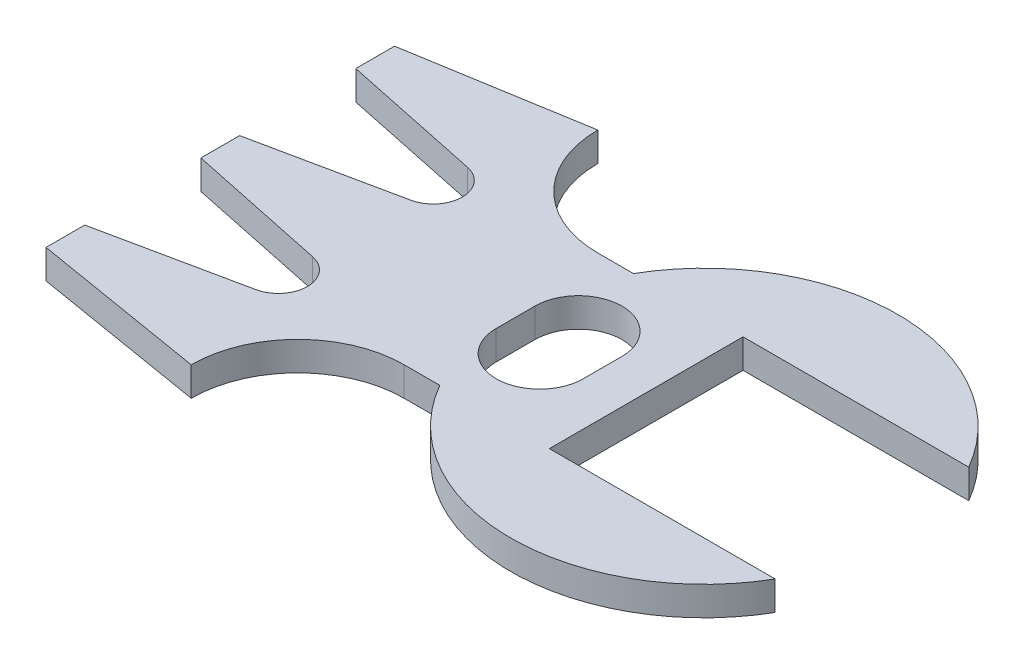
ISO-10303-21;
HEADER;
FILE_DESCRIPTION(('STEP AP214'),'2;1');
FILE_NAME('part.step','',(''),(''),'','','');
FILE_SCHEMA(('AUTOMOTIVE_DESIGN { 1 0 10303 214 1 1 1 1 }'));
ENDSEC;
DATA;
#1=APPLICATION_CONTEXT('core data for automotive mechanical design processes');
#2=APPLICATION_PROTOCOL_DEFINITION('international standard','automotive_design',2000,#1);
#3=PRODUCT_CONTEXT('',#1,'mechanical');
#4=PRODUCT('Part','Part','',(#3));
#5=PRODUCT_RELATED_PRODUCT_CATEGORY('part','',(#4));
#6=PRODUCT_DEFINITION_FORMATION('','',#4);
#7=PRODUCT_DEFINITION_CONTEXT('part definition',#1,'design');
#8=PRODUCT_DEFINITION('design','',#6,#7);
#9=PRODUCT_DEFINITION_SHAPE('','',#8);
#10=(LENGTH_UNIT() NAMED_UNIT(*) SI_UNIT(.MILLI.,.METRE.));
#11=(NAMED_UNIT(*) PLANE_ANGLE_UNIT() SI_UNIT($,.RADIAN.));
#12=(NAMED_UNIT(*) SI_UNIT($,.STERADIAN.) SOLID_ANGLE_UNIT());
#13=UNCERTAINTY_MEASURE_WITH_UNIT(LENGTH_MEASURE(1.E-05),#10,'distance_accuracy_value','');
#14=(GEOMETRIC_REPRESENTATION_CONTEXT(3) GLOBAL_UNCERTAINTY_ASSIGNED_CONTEXT((#13)) GLOBAL_UNIT_ASSIGNED_CONTEXT((#10,
#11,#12)) REPRESENTATION_CONTEXT('',''));
#15=CARTESIAN_POINT('',(0.,0.,0.));
#16=DIRECTION('',(0.,0.,1.));
#17=DIRECTION('',(1.,0.,0.));
#18=AXIS2_PLACEMENT_3D('',#15,#16,#17);
#19=CARTESIAN_POINT('',(50.,3.,-21.));
#20=DIRECTION('',(0.,1.,0.));
#21=DIRECTION('',(0.,0.,1.));
#22=AXIS2_PLACEMENT_3D('',#19,#20,#21);
#23=PLANE('',#22);
#24=CARTESIAN_POINT('',(50.,3.,-21.));
#25=DIRECTION('',(0.,1.,0.));
#26=DIRECTION('',(0.,0.,1.));
#27=AXIS2_PLACEMENT_3D('',#24,#25,#26);
#28=CIRCLE('',#27,20.);
#29=CARTESIAN_POINT('',(67.3205080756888,3.,-31.));
#30=VERTEX_POINT('',#29);
#31=CARTESIAN_POINT('',(32.6794919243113,3.,-31.));
#32=VERTEX_POINT('',#31);
#33=EDGE_CURVE('E228',#30,#32,#28,.T.);
#34=ORIENTED_EDGE('',*,*,#33,.T.);
#35=DIRECTION('',(-1.,0.,0.));
#36=VECTOR('',#35,1.);
#37=CARTESIAN_POINT('',(29.,3.,-31.));
#38=LINE('',#37,#36);
#39=CARTESIAN_POINT('',(29.,3.,-31.));
#40=VERTEX_POINT('',#39);
#41=EDGE_CURVE('E231',#32,#40,#38,.T.);
#42=ORIENTED_EDGE('',*,*,#41,.T.);
#43=CARTESIAN_POINT('',(29.,3.,-42.));
#44=DIRECTION('',(0.,-1.,0.));
#45=DIRECTION('',(0.,0.,1.));
#46=AXIS2_PLACEMENT_3D('',#43,#44,#45);
#47=CIRCLE('',#46,11.);
#48=CARTESIAN_POINT('',(18.,3.,-42.));
#49=VERTEX_POINT('',#48);
#50=EDGE_CURVE('E234',#40,#49,#47,.T.);
#51=ORIENTED_EDGE('',*,*,#50,.T.);
#52=DIRECTION('',(-0.986393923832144,0.,0.164398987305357));
#53=VECTOR('',#52,1.);
#54=CARTESIAN_POINT('',(18.,3.,-42.));
#55=LINE('',#54,#53);
#56=CARTESIAN_POINT('',(0.,3.,-39.));
#57=VERTEX_POINT('',#56);
#58=EDGE_CURVE('E236',#49,#57,#55,.T.);
#59=ORIENTED_EDGE('',*,*,#58,.T.);
#60=DIRECTION('',(0.,0.,1.));
#61=VECTOR('',#60,1.);
#62=CARTESIAN_POINT('',(0.,3.,-35.));
#63=LINE('',#62,#61);
#64=CARTESIAN_POINT('',(0.,3.,-35.));
#65=VERTEX_POINT('',#64);
#66=EDGE_CURVE('E238',#57,#65,#63,.T.);
#67=ORIENTED_EDGE('',*,*,#66,.T.);
#68=DIRECTION('',(0.978726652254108,0.,0.205168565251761));
#69=VECTOR('',#68,1.);
#70=CARTESIAN_POINT('',(0.,3.,-35.));
#71=LINE('',#70,#69);
#72=CARTESIAN_POINT('',(14.6155056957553,3.,-31.9361799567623));
#73=VERTEX_POINT('',#72);
#74=EDGE_CURVE('E240',#65,#73,#71,.T.);
#75=ORIENTED_EDGE('',*,*,#74,.T.);
#76=CARTESIAN_POINT('',(14.,3.,-29.));
#77=DIRECTION('',(0.,-1.,0.));
#78=DIRECTION('',(0.,0.,1.));
#79=AXIS2_PLACEMENT_3D('',#76,#77,#78);
#80=CIRCLE('',#79,2.99999999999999);
#81=CARTESIAN_POINT('',(14.6155056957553,3.,-26.0638200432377));
#82=VERTEX_POINT('',#81);
#83=EDGE_CURVE('E242',#73,#82,#80,.T.);
#84=ORIENTED_EDGE('',*,*,#83,.T.);
#85=DIRECTION('',(-0.978726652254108,0.,0.205168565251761));
#86=VECTOR('',#85,1.);
#87=CARTESIAN_POINT('',(0.,3.,-23.));
#88=LINE('',#87,#86);
#89=CARTESIAN_POINT('',(0.,3.,-23.));
#90=VERTEX_POINT('',#89);
#91=EDGE_CURVE('E244',#82,#90,#88,.T.);
#92=ORIENTED_EDGE('',*,*,#91,.T.);
#93=DIRECTION('',(0.,0.,1.));
#94=VECTOR('',#93,1.);
#95=CARTESIAN_POINT('',(0.,3.,-19.));
#96=LINE('',#95,#94);
#97=CARTESIAN_POINT('',(0.,3.,-19.));
#98=VERTEX_POINT('',#97);
#99=EDGE_CURVE('E246',#90,#98,#96,.T.);
#100=ORIENTED_EDGE('',*,*,#99,.T.);
#101=DIRECTION('',(0.978726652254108,0.,0.205168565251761));
#102=VECTOR('',#101,1.);
#103=CARTESIAN_POINT('',(0.,3.,-19.));
#104=LINE('',#103,#102);
#105=CARTESIAN_POINT('',(14.6155056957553,3.,-15.9361799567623));
#106=VERTEX_POINT('',#105);
#107=EDGE_CURVE('E248',#98,#106,#104,.T.);
#108=ORIENTED_EDGE('',*,*,#107,.T.);
#109=CARTESIAN_POINT('',(14.,3.,-13.));
#110=DIRECTION('',(0.,-1.,0.));
#111=DIRECTION('',(0.,0.,1.));
#112=AXIS2_PLACEMENT_3D('',#109,#110,#111);
#113=CIRCLE('',#112,3.);
#114=CARTESIAN_POINT('',(14.6155056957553,3.,-10.0638200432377));
#115=VERTEX_POINT('',#114);
#116=EDGE_CURVE('E250',#106,#115,#113,.T.);
#117=ORIENTED_EDGE('',*,*,#116,.T.);
#118=DIRECTION('',(-0.978726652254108,0.,0.205168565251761));
#119=VECTOR('',#118,1.);
#120=CARTESIAN_POINT('',(0.,3.,-7.));
#121=LINE('',#120,#119);
#122=CARTESIAN_POINT('',(0.,3.,-7.));
#123=VERTEX_POINT('',#122);
#124=EDGE_CURVE('E252',#115,#123,#121,.T.);
#125=ORIENTED_EDGE('',*,*,#124,.T.);
#126=DIRECTION('',(0.,0.,1.));
#127=VECTOR('',#126,1.);
#128=CARTESIAN_POINT('',(0.,3.,-3.));
#129=LINE('',#128,#127);
#130=CARTESIAN_POINT('',(0.,3.,-3.));
#131=VERTEX_POINT('',#130);
#132=EDGE_CURVE('E254',#123,#131,#129,.T.);
#133=ORIENTED_EDGE('',*,*,#132,.T.);
#134=DIRECTION('',(0.986393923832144,0.,0.164398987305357));
#135=VECTOR('',#134,1.);
#136=CARTESIAN_POINT('',(18.,3.,0.));
#137=LINE('',#136,#135);
#138=CARTESIAN_POINT('',(18.,3.,0.));
#139=VERTEX_POINT('',#138);
#140=EDGE_CURVE('E256',#131,#139,#137,.T.);
#141=ORIENTED_EDGE('',*,*,#140,.T.);
#142=CARTESIAN_POINT('',(29.,3.,0.));
#143=DIRECTION('',(0.,-1.,0.));
#144=DIRECTION('',(0.,0.,1.));
#145=AXIS2_PLACEMENT_3D('',#142,#143,#144);
#146=CIRCLE('',#145,11.);
#147=CARTESIAN_POINT('',(29.,3.,-11.));
#148=VERTEX_POINT('',#147);
#149=EDGE_CURVE('E258',#139,#148,#146,.T.);
#150=ORIENTED_EDGE('',*,*,#149,.T.);
#151=DIRECTION('',(1.,0.,0.));
#152=VECTOR('',#151,1.);
#153=CARTESIAN_POINT('',(29.,3.,-11.));
#154=LINE('',#153,#152);
#155=CARTESIAN_POINT('',(32.6794919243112,3.,-11.));
#156=VERTEX_POINT('',#155);
#157=EDGE_CURVE('E260',#148,#156,#154,.T.);
#158=ORIENTED_EDGE('',*,*,#157,.T.);
#159=CARTESIAN_POINT('',(50.,3.,-21.));
#160=DIRECTION('',(0.,1.,0.));
#161=DIRECTION('',(0.,0.,1.));
#162=AXIS2_PLACEMENT_3D('',#159,#160,#161);
#163=CIRCLE('',#162,20.);
#164=CARTESIAN_POINT('',(67.3205080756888,3.,-11.));
#165=VERTEX_POINT('',#164);
#166=EDGE_CURVE('E262',#156,#165,#163,.T.);
#167=ORIENTED_EDGE('',*,*,#166,.T.);
#168=DIRECTION('',(-1.,0.,0.));
#169=VECTOR('',#168,1.);
#170=CARTESIAN_POINT('',(44.,3.,-11.));
#171=LINE('',#170,#169);
#172=CARTESIAN_POINT('',(44.,3.,-11.));
#173=VERTEX_POINT('',#172);
#174=EDGE_CURVE('E264',#165,#173,#171,.T.);
#175=ORIENTED_EDGE('',*,*,#174,.T.);
#176=DIRECTION('',(0.,0.,-1.));
#177=VECTOR('',#176,1.);
#178=CARTESIAN_POINT('',(44.,3.,-31.));
#179=LINE('',#178,#177);
#180=CARTESIAN_POINT('',(44.,3.,-31.));
#181=VERTEX_POINT('',#180);
#182=EDGE_CURVE('E266',#173,#181,#179,.T.);
#183=ORIENTED_EDGE('',*,*,#182,.T.);
#184=DIRECTION('',(1.,0.,0.));
#185=VECTOR('',#184,1.);
#186=CARTESIAN_POINT('',(67.3205080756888,3.,-31.));
#187=LINE('',#186,#185);
#188=EDGE_CURVE('E268',#181,#30,#187,.T.);
#189=ORIENTED_EDGE('',*,*,#188,.T.);
#190=EDGE_LOOP('',(#34,#42,#51,#59,#67,#75,#84,#92,#100,#108,#117,#125,#133,#141,#150,#158,#167,
#175,#183,#189));
#191=FACE_BOUND('',#190,.T.);
#192=DIRECTION('',(0.,0.,1.));
#193=VECTOR('',#192,1.);
#194=CARTESIAN_POINT('',(30.5,3.,-23.));
#195=LINE('',#194,#193);
#196=CARTESIAN_POINT('',(30.5,3.,-23.));
#197=VERTEX_POINT('',#196);
#198=CARTESIAN_POINT('',(30.5,3.,-19.));
#199=VERTEX_POINT('',#198);
#200=EDGE_CURVE('E200',#197,#199,#195,.T.);
#201=ORIENTED_EDGE('',*,*,#200,.F.);
#202=CARTESIAN_POINT('',(35.,3.,-23.));
#203=DIRECTION('',(0.,1.,0.));
#204=DIRECTION('',(0.,0.,1.));
#205=AXIS2_PLACEMENT_3D('',#202,#203,#204);
#206=CIRCLE('',#205,4.5);
#207=CARTESIAN_POINT('',(39.5,3.,-23.));
#208=VERTEX_POINT('',#207);
#209=EDGE_CURVE('E192',#208,#197,#206,.T.);
#210=ORIENTED_EDGE('',*,*,#209,.F.);
#211=DIRECTION('',(0.,0.,-1.));
#212=VECTOR('',#211,1.);
#213=CARTESIAN_POINT('',(39.5,3.,-23.));
#214=LINE('',#213,#212);
#215=CARTESIAN_POINT('',(39.5,3.,-19.));
#216=VERTEX_POINT('',#215);
#217=EDGE_CURVE('E214',#216,#208,#214,.T.);
#218=ORIENTED_EDGE('',*,*,#217,.F.);
#219=CARTESIAN_POINT('',(35.,3.,-19.));
#220=DIRECTION('',(0.,1.,0.));
#221=DIRECTION('',(0.,0.,1.));
#222=AXIS2_PLACEMENT_3D('',#219,#220,#221);
#223=CIRCLE('',#222,4.5);
#224=EDGE_CURVE('E212',#199,#216,#223,.T.);
#225=ORIENTED_EDGE('',*,*,#224,.F.);
#226=EDGE_LOOP('',(#201,#210,#218,#225));
#227=FACE_BOUND('',#226,.T.);
#228=ADVANCED_FACE('F31',(#191,#227),#23,.T.);
#229=CARTESIAN_POINT('',(50.,0.,-21.));
#230=DIRECTION('',(0.,1.,0.));
#231=DIRECTION('',(0.,0.,1.));
#232=AXIS2_PLACEMENT_3D('',#229,#230,#231);
#233=PLANE('',#232);
#234=CARTESIAN_POINT('',(50.,0.,-21.));
#235=DIRECTION('',(0.,1.,0.));
#236=DIRECTION('',(0.,0.,1.));
#237=AXIS2_PLACEMENT_3D('',#234,#235,#236);
#238=CIRCLE('',#237,20.);
#239=CARTESIAN_POINT('',(67.3205080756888,0.,-31.));
#240=VERTEX_POINT('',#239);
#241=CARTESIAN_POINT('',(32.6794919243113,0.,-31.));
#242=VERTEX_POINT('',#241);
#243=EDGE_CURVE('E208',#240,#242,#238,.T.);
#244=ORIENTED_EDGE('',*,*,#243,.F.);
#245=DIRECTION('',(1.,0.,0.));
#246=VECTOR('',#245,1.);
#247=CARTESIAN_POINT('',(67.3205080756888,0.,-31.));
#248=LINE('',#247,#246);
#249=CARTESIAN_POINT('',(44.,0.,-31.));
#250=VERTEX_POINT('',#249);
#251=EDGE_CURVE('E232',#250,#240,#248,.T.);
#252=ORIENTED_EDGE('',*,*,#251,.F.);
#253=DIRECTION('',(0.,0.,-1.));
#254=VECTOR('',#253,1.);
#255=CARTESIAN_POINT('',(44.,0.,-31.));
#256=LINE('',#255,#254);
#257=CARTESIAN_POINT('',(44.,0.,-11.));
#258=VERTEX_POINT('',#257);
#259=EDGE_CURVE('E307',#258,#250,#256,.T.);
#260=ORIENTED_EDGE('',*,*,#259,.F.);
#261=DIRECTION('',(-1.,0.,0.));
#262=VECTOR('',#261,1.);
#263=CARTESIAN_POINT('',(44.,0.,-11.));
#264=LINE('',#263,#262);
#265=CARTESIAN_POINT('',(67.3205080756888,0.,-11.));
#266=VERTEX_POINT('',#265);
#267=EDGE_CURVE('E305',#266,#258,#264,.T.);
#268=ORIENTED_EDGE('',*,*,#267,.F.);
#269=CARTESIAN_POINT('',(50.,0.,-21.));
#270=DIRECTION('',(0.,1.,0.));
#271=DIRECTION('',(0.,0.,1.));
#272=AXIS2_PLACEMENT_3D('',#269,#270,#271);
#273=CIRCLE('',#272,20.);
#274=CARTESIAN_POINT('',(32.6794919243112,0.,-11.));
#275=VERTEX_POINT('',#274);
#276=EDGE_CURVE('E303',#275,#266,#273,.T.);
#277=ORIENTED_EDGE('',*,*,#276,.F.);
#278=DIRECTION('',(1.,0.,0.));
#279=VECTOR('',#278,1.);
#280=CARTESIAN_POINT('',(29.,0.,-11.));
#281=LINE('',#280,#279);
#282=CARTESIAN_POINT('',(29.,0.,-11.));
#283=VERTEX_POINT('',#282);
#284=EDGE_CURVE('E301',#283,#275,#281,.T.);
#285=ORIENTED_EDGE('',*,*,#284,.F.);
#286=CARTESIAN_POINT('',(29.,0.,0.));
#287=DIRECTION('',(0.,-1.,0.));
#288=DIRECTION('',(0.,0.,1.));
#289=AXIS2_PLACEMENT_3D('',#286,#287,#288);
#290=CIRCLE('',#289,11.);
#291=CARTESIAN_POINT('',(18.,0.,0.));
#292=VERTEX_POINT('',#291);
#293=EDGE_CURVE('E299',#292,#283,#290,.T.);
#294=ORIENTED_EDGE('',*,*,#293,.F.);
#295=DIRECTION('',(0.986393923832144,0.,0.164398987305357));
#296=VECTOR('',#295,1.);
#297=CARTESIAN_POINT('',(18.,0.,0.));
#298=LINE('',#297,#296);
#299=CARTESIAN_POINT('',(0.,0.,-3.));
#300=VERTEX_POINT('',#299);
#301=EDGE_CURVE('E297',#300,#292,#298,.T.);
#302=ORIENTED_EDGE('',*,*,#301,.F.);
#303=DIRECTION('',(0.,0.,1.));
#304=VECTOR('',#303,1.);
#305=CARTESIAN_POINT('',(0.,0.,-3.));
#306=LINE('',#305,#304);
#307=CARTESIAN_POINT('',(0.,0.,-7.));
#308=VERTEX_POINT('',#307);
#309=EDGE_CURVE('E295',#308,#300,#306,.T.);
#310=ORIENTED_EDGE('',*,*,#309,.F.);
#311=DIRECTION('',(-0.978726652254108,0.,0.205168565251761));
#312=VECTOR('',#311,1.);
#313=CARTESIAN_POINT('',(0.,0.,-7.));
#314=LINE('',#313,#312);
#315=CARTESIAN_POINT('',(14.6155056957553,0.,-10.0638200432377));
#316=VERTEX_POINT('',#315);
#317=EDGE_CURVE('E293',#316,#308,#314,.T.);
#318=ORIENTED_EDGE('',*,*,#317,.F.);
#319=CARTESIAN_POINT('',(14.,0.,-13.));
#320=DIRECTION('',(0.,-1.,0.));
#321=DIRECTION('',(0.,0.,1.));
#322=AXIS2_PLACEMENT_3D('',#319,#320,#321);
#323=CIRCLE('',#322,3.);
#324=CARTESIAN_POINT('',(14.6155056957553,0.,-15.9361799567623));
#325=VERTEX_POINT('',#324);
#326=EDGE_CURVE('E291',#325,#316,#323,.T.);
#327=ORIENTED_EDGE('',*,*,#326,.F.);
#328=DIRECTION('',(0.978726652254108,0.,0.205168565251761));
#329=VECTOR('',#328,1.);
#330=CARTESIAN_POINT('',(0.,0.,-19.));
#331=LINE('',#330,#329);
#332=CARTESIAN_POINT('',(0.,0.,-19.));
#333=VERTEX_POINT('',#332);
#334=EDGE_CURVE('E289',#333,#325,#331,.T.);
#335=ORIENTED_EDGE('',*,*,#334,.F.);
#336=DIRECTION('',(0.,0.,1.));
#337=VECTOR('',#336,1.);
#338=CARTESIAN_POINT('',(0.,0.,-19.));
#339=LINE('',#338,#337);
#340=CARTESIAN_POINT('',(0.,0.,-23.));
#341=VERTEX_POINT('',#340);
#342=EDGE_CURVE('E287',#341,#333,#339,.T.);
#343=ORIENTED_EDGE('',*,*,#342,.F.);
#344=DIRECTION('',(-0.978726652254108,0.,0.205168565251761));
#345=VECTOR('',#344,1.);
#346=CARTESIAN_POINT('',(0.,0.,-23.));
#347=LINE('',#346,#345);
#348=CARTESIAN_POINT('',(14.6155056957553,0.,-26.0638200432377));
#349=VERTEX_POINT('',#348);
#350=EDGE_CURVE('E285',#349,#341,#347,.T.);
#351=ORIENTED_EDGE('',*,*,#350,.F.);
#352=CARTESIAN_POINT('',(14.,0.,-29.));
#353=DIRECTION('',(0.,-1.,0.));
#354=DIRECTION('',(0.,0.,1.));
#355=AXIS2_PLACEMENT_3D('',#352,#353,#354);
#356=CIRCLE('',#355,2.99999999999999);
#357=CARTESIAN_POINT('',(14.6155056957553,0.,-31.9361799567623));
#358=VERTEX_POINT('',#357);
#359=EDGE_CURVE('E283',#358,#349,#356,.T.);
#360=ORIENTED_EDGE('',*,*,#359,.F.);
#361=DIRECTION('',(0.978726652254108,0.,0.205168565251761));
#362=VECTOR('',#361,1.);
#363=CARTESIAN_POINT('',(0.,0.,-35.));
#364=LINE('',#363,#362);
#365=CARTESIAN_POINT('',(0.,0.,-35.));
#366=VERTEX_POINT('',#365);
#367=EDGE_CURVE('E281',#366,#358,#364,.T.);
#368=ORIENTED_EDGE('',*,*,#367,.F.);
#369=DIRECTION('',(0.,0.,1.));
#370=VECTOR('',#369,1.);
#371=CARTESIAN_POINT('',(0.,0.,-35.));
#372=LINE('',#371,#370);
#373=CARTESIAN_POINT('',(0.,0.,-39.));
#374=VERTEX_POINT('',#373);
#375=EDGE_CURVE('E279',#374,#366,#372,.T.);
#376=ORIENTED_EDGE('',*,*,#375,.F.);
#377=DIRECTION('',(-0.986393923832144,0.,0.164398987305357));
#378=VECTOR('',#377,1.);
#379=CARTESIAN_POINT('',(18.,0.,-42.));
#380=LINE('',#379,#378);
#381=CARTESIAN_POINT('',(18.,0.,-42.));
#382=VERTEX_POINT('',#381);
#383=EDGE_CURVE('E277',#382,#374,#380,.T.);
#384=ORIENTED_EDGE('',*,*,#383,.F.);
#385=CARTESIAN_POINT('',(29.,0.,-42.));
#386=DIRECTION('',(0.,-1.,0.));
#387=DIRECTION('',(0.,0.,1.));
#388=AXIS2_PLACEMENT_3D('',#385,#386,#387);
#389=CIRCLE('',#388,11.);
#390=CARTESIAN_POINT('',(29.,0.,-31.));
#391=VERTEX_POINT('',#390);
#392=EDGE_CURVE('E275',#391,#382,#389,.T.);
#393=ORIENTED_EDGE('',*,*,#392,.F.);
#394=DIRECTION('',(-1.,0.,0.));
#395=VECTOR('',#394,1.);
#396=CARTESIAN_POINT('',(29.,0.,-31.));
#397=LINE('',#396,#395);
#398=EDGE_CURVE('E273',#242,#391,#397,.T.);
#399=ORIENTED_EDGE('',*,*,#398,.F.);
#400=EDGE_LOOP('',(#244,#252,#260,#268,#277,#285,#294,#302,#310,#318,#327,#335,#343,#351,#360,
#368,#376,#384,#393,#399));
#401=FACE_BOUND('',#400,.T.);
#402=CARTESIAN_POINT('',(35.,0.,-23.));
#403=DIRECTION('',(0.,1.,0.));
#404=DIRECTION('',(0.,0.,1.));
#405=AXIS2_PLACEMENT_3D('',#402,#403,#404);
#406=CIRCLE('',#405,4.5);
#407=CARTESIAN_POINT('',(39.5,0.,-23.));
#408=VERTEX_POINT('',#407);
#409=CARTESIAN_POINT('',(30.5,0.,-23.));
#410=VERTEX_POINT('',#409);
#411=EDGE_CURVE('E54',#408,#410,#406,.T.);
#412=ORIENTED_EDGE('',*,*,#411,.T.);
#413=DIRECTION('',(0.,0.,1.));
#414=VECTOR('',#413,1.);
#415=CARTESIAN_POINT('',(30.5,0.,-23.));
#416=LINE('',#415,#414);
#417=CARTESIAN_POINT('',(30.5,0.,-19.));
#418=VERTEX_POINT('',#417);
#419=EDGE_CURVE('E207',#410,#418,#416,.T.);
#420=ORIENTED_EDGE('',*,*,#419,.T.);
#421=CARTESIAN_POINT('',(35.,0.,-19.));
#422=DIRECTION('',(0.,1.,0.));
#423=DIRECTION('',(0.,0.,1.));
#424=AXIS2_PLACEMENT_3D('',#421,#422,#423);
#425=CIRCLE('',#424,4.5);
#426=CARTESIAN_POINT('',(39.5,0.,-19.));
#427=VERTEX_POINT('',#426);
#428=EDGE_CURVE('E220',#418,#427,#425,.T.);
#429=ORIENTED_EDGE('',*,*,#428,.T.);
#430=DIRECTION('',(0.,0.,-1.));
#431=VECTOR('',#430,1.);
#432=CARTESIAN_POINT('',(39.5,0.,-23.));
#433=LINE('',#432,#431);
#434=EDGE_CURVE('E201',#427,#408,#433,.T.);
#435=ORIENTED_EDGE('',*,*,#434,.T.);
#436=EDGE_LOOP('',(#412,#420,#429,#435));
#437=FACE_BOUND('',#436,.T.);
#438=ADVANCED_FACE('F373',(#401,#437),#233,.F.);
#439=CARTESIAN_POINT('',(50.,3.,-21.));
#440=DIRECTION('',(0.,-1.,0.));
#441=DIRECTION('',(0.,0.,-1.));
#442=AXIS2_PLACEMENT_3D('',#439,#440,#441);
#443=CYLINDRICAL_SURFACE('',#442,20.);
#444=ORIENTED_EDGE('',*,*,#243,.T.);
#445=DIRECTION('',(0.,-1.,0.));
#446=VECTOR('',#445,1.);
#447=CARTESIAN_POINT('',(32.6794919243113,3.,-31.));
#448=LINE('',#447,#446);
#449=EDGE_CURVE('E11',#32,#242,#448,.T.);
#450=ORIENTED_EDGE('',*,*,#449,.F.);
#451=ORIENTED_EDGE('',*,*,#33,.F.);
#452=DIRECTION('',(0.,-1.,0.));
#453=VECTOR('',#452,1.);
#454=CARTESIAN_POINT('',(67.3205080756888,3.,-31.));
#455=LINE('',#454,#453);
#456=EDGE_CURVE('E270',#30,#240,#455,.T.);
#457=ORIENTED_EDGE('',*,*,#456,.T.);
#458=EDGE_LOOP('',(#444,#450,#451,#457));
#459=FACE_BOUND('',#458,.T.);
#460=ADVANCED_FACE('F33',(#459),#443,.T.);
#461=CARTESIAN_POINT('',(29.,3.,-31.));
#462=DIRECTION('',(0.,0.,1.));
#463=DIRECTION('',(1.,0.,0.));
#464=AXIS2_PLACEMENT_3D('',#461,#462,#463);
#465=PLANE('',#464);
#466=ORIENTED_EDGE('',*,*,#398,.T.);
#467=DIRECTION('',(0.,-1.,0.));
#468=VECTOR('',#467,1.);
#469=CARTESIAN_POINT('',(29.,3.,-31.));
#470=LINE('',#469,#468);
#471=EDGE_CURVE('E39',#40,#391,#470,.T.);
#472=ORIENTED_EDGE('',*,*,#471,.F.);
#473=ORIENTED_EDGE('',*,*,#41,.F.);
#474=ORIENTED_EDGE('',*,*,#449,.T.);
#475=EDGE_LOOP('',(#466,#472,#473,#474));
#476=FACE_BOUND('',#475,.T.);
#477=ADVANCED_FACE('F390',(#476),#465,.F.);
#478=CARTESIAN_POINT('',(29.,3.,-42.));
#479=DIRECTION('',(0.,-1.,0.));
#480=DIRECTION('',(0.,0.,-1.));
#481=AXIS2_PLACEMENT_3D('',#478,#479,#480);
#482=CYLINDRICAL_SURFACE('',#481,11.);
#483=ORIENTED_EDGE('',*,*,#392,.T.);
#484=DIRECTION('',(0.,-1.,0.));
#485=VECTOR('',#484,1.);
#486=CARTESIAN_POINT('',(18.,3.,-42.));
#487=LINE('',#486,#485);
#488=EDGE_CURVE('E360',#49,#382,#487,.T.);
#489=ORIENTED_EDGE('',*,*,#488,.F.);
#490=ORIENTED_EDGE('',*,*,#50,.F.);
#491=ORIENTED_EDGE('',*,*,#471,.T.);
#492=EDGE_LOOP('',(#483,#489,#490,#491));
#493=FACE_BOUND('',#492,.T.);
#494=ADVANCED_FACE('F367',(#493),#482,.F.);
#495=CARTESIAN_POINT('',(18.,3.,-42.));
#496=DIRECTION('',(0.164398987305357,0.,0.986393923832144));
#497=DIRECTION('',(0.986393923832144,0.,-0.164398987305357));
#498=AXIS2_PLACEMENT_3D('',#495,#496,#497);
#499=PLANE('',#498);
#500=ORIENTED_EDGE('',*,*,#383,.T.);
#501=DIRECTION('',(0.,-1.,0.));
#502=VECTOR('',#501,1.);
#503=CARTESIAN_POINT('',(0.,3.,-39.));
#504=LINE('',#503,#502);
#505=EDGE_CURVE('E357',#57,#374,#504,.T.);
#506=ORIENTED_EDGE('',*,*,#505,.F.);
#507=ORIENTED_EDGE('',*,*,#58,.F.);
#508=ORIENTED_EDGE('',*,*,#488,.T.);
#509=EDGE_LOOP('',(#500,#506,#507,#508));
#510=FACE_BOUND('',#509,.T.);
#511=ADVANCED_FACE('F379',(#510),#499,.F.);
#512=CARTESIAN_POINT('',(0.,3.,-35.));
#513=DIRECTION('',(1.,0.,0.));
#514=DIRECTION('',(0.,0.,-1.));
#515=AXIS2_PLACEMENT_3D('',#512,#513,#514);
#516=PLANE('',#515);
#517=ORIENTED_EDGE('',*,*,#375,.T.);
#518=DIRECTION('',(0.,-1.,0.));
#519=VECTOR('',#518,1.);
#520=CARTESIAN_POINT('',(0.,3.,-35.));
#521=LINE('',#520,#519);
#522=EDGE_CURVE('E354',#65,#366,#521,.T.);
#523=ORIENTED_EDGE('',*,*,#522,.F.);
#524=ORIENTED_EDGE('',*,*,#66,.F.);
#525=ORIENTED_EDGE('',*,*,#505,.T.);
#526=EDGE_LOOP('',(#517,#523,#524,#525));
#527=FACE_BOUND('',#526,.T.);
#528=ADVANCED_FACE('F383',(#527),#516,.F.);
#529=CARTESIAN_POINT('',(0.,3.,-35.));
#530=DIRECTION('',(0.205168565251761,0.,-0.978726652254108));
#531=DIRECTION('',(-0.978726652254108,0.,-0.205168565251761));
#532=AXIS2_PLACEMENT_3D('',#529,#530,#531);
#533=PLANE('',#532);
#534=ORIENTED_EDGE('',*,*,#367,.T.);
#535=DIRECTION('',(0.,-1.,0.));
#536=VECTOR('',#535,1.);
#537=CARTESIAN_POINT('',(14.6155056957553,3.,-31.9361799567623));
#538=LINE('',#537,#536);
#539=EDGE_CURVE('E351',#73,#358,#538,.T.);
#540=ORIENTED_EDGE('',*,*,#539,.F.);
#541=ORIENTED_EDGE('',*,*,#74,.F.);
#542=ORIENTED_EDGE('',*,*,#522,.T.);
#543=EDGE_LOOP('',(#534,#540,#541,#542));
#544=FACE_BOUND('',#543,.T.);
#545=ADVANCED_FACE('F463',(#544),#533,.F.);
#546=CARTESIAN_POINT('',(14.,3.,-29.));
#547=DIRECTION('',(0.,-1.,0.));
#548=DIRECTION('',(0.,0.,-1.));
#549=AXIS2_PLACEMENT_3D('',#546,#547,#548);
#550=CYLINDRICAL_SURFACE('',#549,2.99999999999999);
#551=ORIENTED_EDGE('',*,*,#359,.T.);
#552=DIRECTION('',(0.,-1.,0.));
#553=VECTOR('',#552,1.);
#554=CARTESIAN_POINT('',(14.6155056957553,3.,-26.0638200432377));
#555=LINE('',#554,#553);
#556=EDGE_CURVE('E348',#82,#349,#555,.T.);
#557=ORIENTED_EDGE('',*,*,#556,.F.);
#558=ORIENTED_EDGE('',*,*,#83,.F.);
#559=ORIENTED_EDGE('',*,*,#539,.T.);
#560=EDGE_LOOP('',(#551,#557,#558,#559));
#561=FACE_BOUND('',#560,.T.);
#562=ADVANCED_FACE('F461',(#561),#550,.F.);
#563=CARTESIAN_POINT('',(0.,3.,-23.));
#564=DIRECTION('',(0.205168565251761,0.,0.978726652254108));
#565=DIRECTION('',(0.978726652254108,0.,-0.205168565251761));
#566=AXIS2_PLACEMENT_3D('',#563,#564,#565);
#567=PLANE('',#566);
#568=ORIENTED_EDGE('',*,*,#350,.T.);
#569=DIRECTION('',(0.,-1.,0.));
#570=VECTOR('',#569,1.);
#571=CARTESIAN_POINT('',(0.,3.,-23.));
#572=LINE('',#571,#570);
#573=EDGE_CURVE('E345',#90,#341,#572,.T.);
#574=ORIENTED_EDGE('',*,*,#573,.F.);
#575=ORIENTED_EDGE('',*,*,#91,.F.);
#576=ORIENTED_EDGE('',*,*,#556,.T.);
#577=EDGE_LOOP('',(#568,#574,#575,#576));
#578=FACE_BOUND('',#577,.T.);
#579=ADVANCED_FACE('F456',(#578),#567,.F.);
#580=CARTESIAN_POINT('',(0.,3.,-19.));
#581=DIRECTION('',(1.,0.,0.));
#582=DIRECTION('',(0.,0.,-1.));
#583=AXIS2_PLACEMENT_3D('',#580,#581,#582);
#584=PLANE('',#583);
#585=ORIENTED_EDGE('',*,*,#342,.T.);
#586=DIRECTION('',(0.,-1.,0.));
#587=VECTOR('',#586,1.);
#588=CARTESIAN_POINT('',(0.,3.,-19.));
#589=LINE('',#588,#587);
#590=EDGE_CURVE('E342',#98,#333,#589,.T.);
#591=ORIENTED_EDGE('',*,*,#590,.F.);
#592=ORIENTED_EDGE('',*,*,#99,.F.);
#593=ORIENTED_EDGE('',*,*,#573,.T.);
#594=EDGE_LOOP('',(#585,#591,#592,#593));
#595=FACE_BOUND('',#594,.T.);
#596=ADVANCED_FACE('F451',(#595),#584,.F.);
#597=CARTESIAN_POINT('',(0.,3.,-19.));
#598=DIRECTION('',(0.205168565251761,0.,-0.978726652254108));
#599=DIRECTION('',(-0.978726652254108,0.,-0.205168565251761));
#600=AXIS2_PLACEMENT_3D('',#597,#598,#599);
#601=PLANE('',#600);
#602=ORIENTED_EDGE('',*,*,#334,.T.);
#603=DIRECTION('',(0.,-1.,0.));
#604=VECTOR('',#603,1.);
#605=CARTESIAN_POINT('',(14.6155056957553,3.,-15.9361799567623));
#606=LINE('',#605,#604);
#607=EDGE_CURVE('E339',#106,#325,#606,.T.);
#608=ORIENTED_EDGE('',*,*,#607,.F.);
#609=ORIENTED_EDGE('',*,*,#107,.F.);
#610=ORIENTED_EDGE('',*,*,#590,.T.);
#611=EDGE_LOOP('',(#602,#608,#609,#610));
#612=FACE_BOUND('',#611,.T.);
#613=ADVANCED_FACE('F447',(#612),#601,.F.);
#614=CARTESIAN_POINT('',(14.,3.,-13.));
#615=DIRECTION('',(0.,-1.,0.));
#616=DIRECTION('',(0.,0.,-1.));
#617=AXIS2_PLACEMENT_3D('',#614,#615,#616);
#618=CYLINDRICAL_SURFACE('',#617,3.);
#619=ORIENTED_EDGE('',*,*,#326,.T.);
#620=DIRECTION('',(0.,-1.,0.));
#621=VECTOR('',#620,1.);
#622=CARTESIAN_POINT('',(14.6155056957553,3.,-10.0638200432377));
#623=LINE('',#622,#621);
#624=EDGE_CURVE('E336',#115,#316,#623,.T.);
#625=ORIENTED_EDGE('',*,*,#624,.F.);
#626=ORIENTED_EDGE('',*,*,#116,.F.);
#627=ORIENTED_EDGE('',*,*,#607,.T.);
#628=EDGE_LOOP('',(#619,#625,#626,#627));
#629=FACE_BOUND('',#628,.T.);
#630=ADVANCED_FACE('F442',(#629),#618,.F.);
#631=CARTESIAN_POINT('',(0.,3.,-7.));
#632=DIRECTION('',(0.205168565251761,0.,0.978726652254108));
#633=DIRECTION('',(0.978726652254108,0.,-0.205168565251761));
#634=AXIS2_PLACEMENT_3D('',#631,#632,#633);
#635=PLANE('',#634);
#636=ORIENTED_EDGE('',*,*,#317,.T.);
#637=DIRECTION('',(0.,-1.,0.));
#638=VECTOR('',#637,1.);
#639=CARTESIAN_POINT('',(0.,3.,-7.));
#640=LINE('',#639,#638);
#641=EDGE_CURVE('E333',#123,#308,#640,.T.);
#642=ORIENTED_EDGE('',*,*,#641,.F.);
#643=ORIENTED_EDGE('',*,*,#124,.F.);
#644=ORIENTED_EDGE('',*,*,#624,.T.);
#645=EDGE_LOOP('',(#636,#642,#643,#644));
#646=FACE_BOUND('',#645,.T.);
#647=ADVANCED_FACE('F436',(#646),#635,.F.);
#648=CARTESIAN_POINT('',(0.,3.,-3.));
#649=DIRECTION('',(1.,0.,0.));
#650=DIRECTION('',(0.,0.,-1.));
#651=AXIS2_PLACEMENT_3D('',#648,#649,#650);
#652=PLANE('',#651);
#653=ORIENTED_EDGE('',*,*,#309,.T.);
#654=DIRECTION('',(0.,-1.,0.));
#655=VECTOR('',#654,1.);
#656=CARTESIAN_POINT('',(0.,3.,-3.));
#657=LINE('',#656,#655);
#658=EDGE_CURVE('E330',#131,#300,#657,.T.);
#659=ORIENTED_EDGE('',*,*,#658,.F.);
#660=ORIENTED_EDGE('',*,*,#132,.F.);
#661=ORIENTED_EDGE('',*,*,#641,.T.);
#662=EDGE_LOOP('',(#653,#659,#660,#661));
#663=FACE_BOUND('',#662,.T.);
#664=ADVANCED_FACE('F432',(#663),#652,.F.);
#665=CARTESIAN_POINT('',(18.,3.,0.));
#666=DIRECTION('',(0.164398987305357,0.,-0.986393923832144));
#667=DIRECTION('',(-0.986393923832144,0.,-0.164398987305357));
#668=AXIS2_PLACEMENT_3D('',#665,#666,#667);
#669=PLANE('',#668);
#670=ORIENTED_EDGE('',*,*,#301,.T.);
#671=DIRECTION('',(0.,-1.,0.));
#672=VECTOR('',#671,1.);
#673=CARTESIAN_POINT('',(18.,3.,0.));
#674=LINE('',#673,#672);
#675=EDGE_CURVE('E327',#139,#292,#674,.T.);
#676=ORIENTED_EDGE('',*,*,#675,.F.);
#677=ORIENTED_EDGE('',*,*,#140,.F.);
#678=ORIENTED_EDGE('',*,*,#658,.T.);
#679=EDGE_LOOP('',(#670,#676,#677,#678));
#680=FACE_BOUND('',#679,.T.);
#681=ADVANCED_FACE('F427',(#680),#669,.F.);
#682=CARTESIAN_POINT('',(29.,3.,0.));
#683=DIRECTION('',(0.,-1.,0.));
#684=DIRECTION('',(0.,0.,-1.));
#685=AXIS2_PLACEMENT_3D('',#682,#683,#684);
#686=CYLINDRICAL_SURFACE('',#685,11.);
#687=ORIENTED_EDGE('',*,*,#293,.T.);
#688=DIRECTION('',(0.,-1.,0.));
#689=VECTOR('',#688,1.);
#690=CARTESIAN_POINT('',(29.,3.,-11.));
#691=LINE('',#690,#689);
#692=EDGE_CURVE('E324',#148,#283,#691,.T.);
#693=ORIENTED_EDGE('',*,*,#692,.F.);
#694=ORIENTED_EDGE('',*,*,#149,.F.);
#695=ORIENTED_EDGE('',*,*,#675,.T.);
#696=EDGE_LOOP('',(#687,#693,#694,#695));
#697=FACE_BOUND('',#696,.T.);
#698=ADVANCED_FACE('F421',(#697),#686,.F.);
#699=CARTESIAN_POINT('',(29.,3.,-11.));
#700=DIRECTION('',(0.,0.,-1.));
#701=DIRECTION('',(-1.,0.,0.));
#702=AXIS2_PLACEMENT_3D('',#699,#700,#701);
#703=PLANE('',#702);
#704=ORIENTED_EDGE('',*,*,#284,.T.);
#705=DIRECTION('',(0.,-1.,0.));
#706=VECTOR('',#705,1.);
#707=CARTESIAN_POINT('',(32.6794919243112,3.,-11.));
#708=LINE('',#707,#706);
#709=EDGE_CURVE('E321',#156,#275,#708,.T.);
#710=ORIENTED_EDGE('',*,*,#709,.F.);
#711=ORIENTED_EDGE('',*,*,#157,.F.);
#712=ORIENTED_EDGE('',*,*,#692,.T.);
#713=EDGE_LOOP('',(#704,#710,#711,#712));
#714=FACE_BOUND('',#713,.T.);
#715=ADVANCED_FACE('F417',(#714),#703,.F.);
#716=CARTESIAN_POINT('',(50.,3.,-21.));
#717=DIRECTION('',(0.,-1.,0.));
#718=DIRECTION('',(0.,0.,-1.));
#719=AXIS2_PLACEMENT_3D('',#716,#717,#718);
#720=CYLINDRICAL_SURFACE('',#719,20.);
#721=ORIENTED_EDGE('',*,*,#276,.T.);
#722=DIRECTION('',(0.,-1.,0.));
#723=VECTOR('',#722,1.);
#724=CARTESIAN_POINT('',(67.3205080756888,3.,-11.));
#725=LINE('',#724,#723);
#726=EDGE_CURVE('E318',#165,#266,#725,.T.);
#727=ORIENTED_EDGE('',*,*,#726,.F.);
#728=ORIENTED_EDGE('',*,*,#166,.F.);
#729=ORIENTED_EDGE('',*,*,#709,.T.);
#730=EDGE_LOOP('',(#721,#727,#728,#729));
#731=FACE_BOUND('',#730,.T.);
#732=ADVANCED_FACE('F412',(#731),#720,.T.);
#733=CARTESIAN_POINT('',(44.,3.,-11.));
#734=DIRECTION('',(0.,0.,1.));
#735=DIRECTION('',(1.,0.,0.));
#736=AXIS2_PLACEMENT_3D('',#733,#734,#735);
#737=PLANE('',#736);
#738=ORIENTED_EDGE('',*,*,#267,.T.);
#739=DIRECTION('',(0.,-1.,0.));
#740=VECTOR('',#739,1.);
#741=CARTESIAN_POINT('',(44.,3.,-11.));
#742=LINE('',#741,#740);
#743=EDGE_CURVE('E315',#173,#258,#742,.T.);
#744=ORIENTED_EDGE('',*,*,#743,.F.);
#745=ORIENTED_EDGE('',*,*,#174,.F.);
#746=ORIENTED_EDGE('',*,*,#726,.T.);
#747=EDGE_LOOP('',(#738,#744,#745,#746));
#748=FACE_BOUND('',#747,.T.);
#749=ADVANCED_FACE('F406',(#748),#737,.F.);
#750=CARTESIAN_POINT('',(44.,3.,-31.));
#751=DIRECTION('',(-1.,0.,0.));
#752=DIRECTION('',(0.,0.,1.));
#753=AXIS2_PLACEMENT_3D('',#750,#751,#752);
#754=PLANE('',#753);
#755=ORIENTED_EDGE('',*,*,#259,.T.);
#756=DIRECTION('',(0.,-1.,0.));
#757=VECTOR('',#756,1.);
#758=CARTESIAN_POINT('',(44.,3.,-31.));
#759=LINE('',#758,#757);
#760=EDGE_CURVE('E312',#181,#250,#759,.T.);
#761=ORIENTED_EDGE('',*,*,#760,.F.);
#762=ORIENTED_EDGE('',*,*,#182,.F.);
#763=ORIENTED_EDGE('',*,*,#743,.T.);
#764=EDGE_LOOP('',(#755,#761,#762,#763));
#765=FACE_BOUND('',#764,.T.);
#766=ADVANCED_FACE('F402',(#765),#754,.F.);
#767=CARTESIAN_POINT('',(67.3205080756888,3.,-31.));
#768=DIRECTION('',(0.,0.,-1.));
#769=DIRECTION('',(-1.,0.,0.));
#770=AXIS2_PLACEMENT_3D('',#767,#768,#769);
#771=PLANE('',#770);
#772=ORIENTED_EDGE('',*,*,#251,.T.);
#773=ORIENTED_EDGE('',*,*,#456,.F.);
#774=ORIENTED_EDGE('',*,*,#188,.F.);
#775=ORIENTED_EDGE('',*,*,#760,.T.);
#776=EDGE_LOOP('',(#772,#773,#774,#775));
#777=FACE_BOUND('',#776,.T.);
#778=ADVANCED_FACE('F397',(#777),#771,.F.);
#779=CARTESIAN_POINT('',(35.,3.,-23.));
#780=DIRECTION('',(0.,-1.,0.));
#781=DIRECTION('',(0.,0.,-1.));
#782=AXIS2_PLACEMENT_3D('',#779,#780,#781);
#783=CYLINDRICAL_SURFACE('',#782,4.5);
#784=ORIENTED_EDGE('',*,*,#411,.F.);
#785=DIRECTION('',(0.,-1.,0.));
#786=VECTOR('',#785,1.);
#787=CARTESIAN_POINT('',(39.5,3.,-23.));
#788=LINE('',#787,#786);
#789=EDGE_CURVE('E196',#208,#408,#788,.T.);
#790=ORIENTED_EDGE('',*,*,#789,.F.);
#791=ORIENTED_EDGE('',*,*,#209,.T.);
#792=DIRECTION('',(0.,-1.,0.));
#793=VECTOR('',#792,1.);
#794=CARTESIAN_POINT('',(30.5,3.,-23.));
#795=LINE('',#794,#793);
#796=EDGE_CURVE('E195',#197,#410,#795,.T.);
#797=ORIENTED_EDGE('',*,*,#796,.T.);
#798=EDGE_LOOP('',(#784,#790,#791,#797));
#799=FACE_BOUND('',#798,.T.);
#800=ADVANCED_FACE('F194',(#799),#783,.F.);
#801=CARTESIAN_POINT('',(30.5,3.,-23.));
#802=DIRECTION('',(1.,0.,0.));
#803=DIRECTION('',(0.,0.,-1.));
#804=AXIS2_PLACEMENT_3D('',#801,#802,#803);
#805=PLANE('',#804);
#806=ORIENTED_EDGE('',*,*,#419,.F.);
#807=ORIENTED_EDGE('',*,*,#796,.F.);
#808=ORIENTED_EDGE('',*,*,#200,.T.);
#809=DIRECTION('',(0.,-1.,0.));
#810=VECTOR('',#809,1.);
#811=CARTESIAN_POINT('',(30.5,3.,-19.));
#812=LINE('',#811,#810);
#813=EDGE_CURVE('E209',#199,#418,#812,.T.);
#814=ORIENTED_EDGE('',*,*,#813,.T.);
#815=EDGE_LOOP('',(#806,#807,#808,#814));
#816=FACE_BOUND('',#815,.T.);
#817=ADVANCED_FACE('F204',(#816),#805,.T.);
#818=CARTESIAN_POINT('',(35.,3.,-19.));
#819=DIRECTION('',(0.,-1.,0.));
#820=DIRECTION('',(0.,0.,-1.));
#821=AXIS2_PLACEMENT_3D('',#818,#819,#820);
#822=CYLINDRICAL_SURFACE('',#821,4.5);
#823=ORIENTED_EDGE('',*,*,#428,.F.);
#824=ORIENTED_EDGE('',*,*,#813,.F.);
#825=ORIENTED_EDGE('',*,*,#224,.T.);
#826=DIRECTION('',(0.,-1.,0.));
#827=VECTOR('',#826,1.);
#828=CARTESIAN_POINT('',(39.5,3.,-19.));
#829=LINE('',#828,#827);
#830=EDGE_CURVE('E46',#216,#427,#829,.T.);
#831=ORIENTED_EDGE('',*,*,#830,.T.);
#832=EDGE_LOOP('',(#823,#824,#825,#831));
#833=FACE_BOUND('',#832,.T.);
#834=ADVANCED_FACE('F569',(#833),#822,.F.);
#835=CARTESIAN_POINT('',(39.5,3.,-23.));
#836=DIRECTION('',(-1.,0.,0.));
#837=DIRECTION('',(0.,0.,1.));
#838=AXIS2_PLACEMENT_3D('',#835,#836,#837);
#839=PLANE('',#838);
#840=ORIENTED_EDGE('',*,*,#434,.F.);
#841=ORIENTED_EDGE('',*,*,#830,.F.);
#842=ORIENTED_EDGE('',*,*,#217,.T.);
#843=ORIENTED_EDGE('',*,*,#789,.T.);
#844=EDGE_LOOP('',(#840,#841,#842,#843));
#845=FACE_BOUND('',#844,.T.);
#846=ADVANCED_FACE('F575',(#845),#839,.T.);
#847=CLOSED_SHELL('',(#228,#438,#460,#477,#494,#511,#528,#545,#562,#579,#596,#613,#630,#647,
#664,#681,#698,#715,#732,#749,#766,#778,#800,#817,#834,#846));
#848=MANIFOLD_SOLID_BREP('B2',#847);
#849=ADVANCED_BREP_SHAPE_REPRESENTATION('',(#18,#848),#14);
#850=SHAPE_DEFINITION_REPRESENTATION(#9,#849);
ENDSEC;
END-ISO-10303-21;
